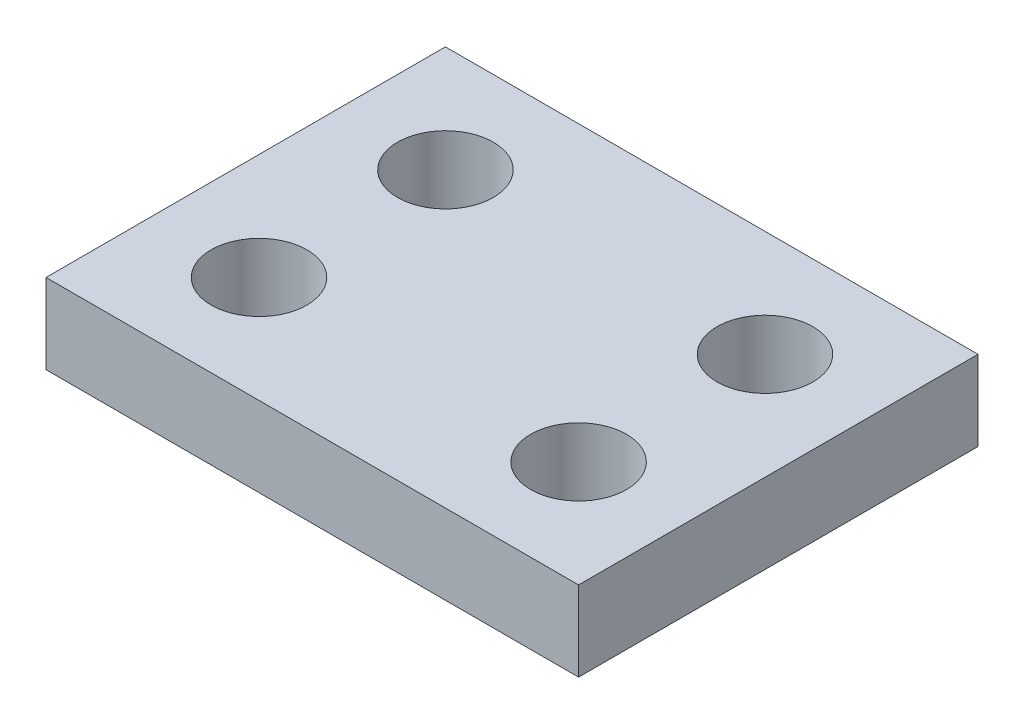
ISO-10303-21;
HEADER;
FILE_DESCRIPTION(('STEP AP214'),'2;1');
FILE_NAME('part.step','',(''),(''),'','','');
FILE_SCHEMA(('AUTOMOTIVE_DESIGN { 1 0 10303 214 1 1 1 1 }'));
ENDSEC;
DATA;
#1=APPLICATION_CONTEXT('core data for automotive mechanical design processes');
#2=APPLICATION_PROTOCOL_DEFINITION('international standard','automotive_design',2000,#1);
#3=PRODUCT_CONTEXT('',#1,'mechanical');
#4=PRODUCT('Part','Part','',(#3));
#5=PRODUCT_RELATED_PRODUCT_CATEGORY('part','',(#4));
#6=PRODUCT_DEFINITION_FORMATION('','',#4);
#7=PRODUCT_DEFINITION_CONTEXT('part definition',#1,'design');
#8=PRODUCT_DEFINITION('design','',#6,#7);
#9=PRODUCT_DEFINITION_SHAPE('','',#8);
#10=(LENGTH_UNIT() NAMED_UNIT(*) SI_UNIT(.MILLI.,.METRE.));
#11=(NAMED_UNIT(*) PLANE_ANGLE_UNIT() SI_UNIT($,.RADIAN.));
#12=(NAMED_UNIT(*) SI_UNIT($,.STERADIAN.) SOLID_ANGLE_UNIT());
#13=UNCERTAINTY_MEASURE_WITH_UNIT(LENGTH_MEASURE(1.E-05),#10,'distance_accuracy_value','');
#14=(GEOMETRIC_REPRESENTATION_CONTEXT(3) GLOBAL_UNCERTAINTY_ASSIGNED_CONTEXT((#13)) GLOBAL_UNIT_ASSIGNED_CONTEXT((#10,
#11,#12)) REPRESENTATION_CONTEXT('',''));
#15=CARTESIAN_POINT('',(0.,0.,0.));
#16=DIRECTION('',(0.,0.,1.));
#17=DIRECTION('',(1.,0.,0.));
#18=AXIS2_PLACEMENT_3D('',#15,#16,#17);
#19=CARTESIAN_POINT('',(50.,15.,37.5));
#20=DIRECTION('',(-1.,0.,0.));
#21=DIRECTION('',(0.,0.,1.));
#22=AXIS2_PLACEMENT_3D('',#19,#20,#21);
#23=PLANE('',#22);
#24=DIRECTION('',(0.,0.,-1.));
#25=VECTOR('',#24,1.);
#26=CARTESIAN_POINT('',(50.,0.,37.5));
#27=LINE('',#26,#25);
#28=CARTESIAN_POINT('',(50.,0.,37.5));
#29=VERTEX_POINT('',#28);
#30=CARTESIAN_POINT('',(50.,0.,-37.5));
#31=VERTEX_POINT('',#30);
#32=EDGE_CURVE('E97',#29,#31,#27,.T.);
#33=ORIENTED_EDGE('',*,*,#32,.T.);
#34=DIRECTION('',(0.,-1.,0.));
#35=VECTOR('',#34,1.);
#36=CARTESIAN_POINT('',(50.,15.,-37.5));
#37=LINE('',#36,#35);
#38=CARTESIAN_POINT('',(50.,15.,-37.5));
#39=VERTEX_POINT('',#38);
#40=EDGE_CURVE('E11',#39,#31,#37,.T.);
#41=ORIENTED_EDGE('',*,*,#40,.F.);
#42=DIRECTION('',(0.,0.,-1.));
#43=VECTOR('',#42,1.);
#44=CARTESIAN_POINT('',(50.,15.,37.5));
#45=LINE('',#44,#43);
#46=CARTESIAN_POINT('',(50.,15.,37.5));
#47=VERTEX_POINT('',#46);
#48=EDGE_CURVE('E85',#47,#39,#45,.T.);
#49=ORIENTED_EDGE('',*,*,#48,.F.);
#50=DIRECTION('',(0.,-1.,0.));
#51=VECTOR('',#50,1.);
#52=CARTESIAN_POINT('',(50.,15.,37.5));
#53=LINE('',#52,#51);
#54=EDGE_CURVE('E93',#47,#29,#53,.T.);
#55=ORIENTED_EDGE('',*,*,#54,.T.);
#56=EDGE_LOOP('',(#33,#41,#49,#55));
#57=FACE_BOUND('',#56,.T.);
#58=ADVANCED_FACE('F34',(#57),#23,.F.);
#59=CARTESIAN_POINT('',(-50.,15.,-37.5));
#60=DIRECTION('',(0.,0.,1.));
#61=DIRECTION('',(1.,0.,0.));
#62=AXIS2_PLACEMENT_3D('',#59,#60,#61);
#63=PLANE('',#62);
#64=DIRECTION('',(-1.,0.,0.));
#65=VECTOR('',#64,1.);
#66=CARTESIAN_POINT('',(-50.,0.,-37.5));
#67=LINE('',#66,#65);
#68=CARTESIAN_POINT('',(-50.,0.,-37.5));
#69=VERTEX_POINT('',#68);
#70=EDGE_CURVE('E89',#31,#69,#67,.T.);
#71=ORIENTED_EDGE('',*,*,#70,.T.);
#72=DIRECTION('',(0.,-1.,0.));
#73=VECTOR('',#72,1.);
#74=CARTESIAN_POINT('',(-50.,15.,-37.5));
#75=LINE('',#74,#73);
#76=CARTESIAN_POINT('',(-50.,15.,-37.5));
#77=VERTEX_POINT('',#76);
#78=EDGE_CURVE('E42',#77,#69,#75,.T.);
#79=ORIENTED_EDGE('',*,*,#78,.F.);
#80=DIRECTION('',(-1.,0.,0.));
#81=VECTOR('',#80,1.);
#82=CARTESIAN_POINT('',(-50.,15.,-37.5));
#83=LINE('',#82,#81);
#84=EDGE_CURVE('E80',#39,#77,#83,.T.);
#85=ORIENTED_EDGE('',*,*,#84,.F.);
#86=ORIENTED_EDGE('',*,*,#40,.T.);
#87=EDGE_LOOP('',(#71,#79,#85,#86));
#88=FACE_BOUND('',#87,.T.);
#89=ADVANCED_FACE('F88',(#88),#63,.F.);
#90=CARTESIAN_POINT('',(-50.,15.,37.5));
#91=DIRECTION('',(1.,0.,0.));
#92=DIRECTION('',(0.,0.,-1.));
#93=AXIS2_PLACEMENT_3D('',#90,#91,#92);
#94=PLANE('',#93);
#95=DIRECTION('',(0.,0.,1.));
#96=VECTOR('',#95,1.);
#97=CARTESIAN_POINT('',(-50.,0.,37.5));
#98=LINE('',#97,#96);
#99=CARTESIAN_POINT('',(-50.,0.,37.5));
#100=VERTEX_POINT('',#99);
#101=EDGE_CURVE('E67',#69,#100,#98,.T.);
#102=ORIENTED_EDGE('',*,*,#101,.T.);
#103=DIRECTION('',(0.,-1.,0.));
#104=VECTOR('',#103,1.);
#105=CARTESIAN_POINT('',(-50.,15.,37.5));
#106=LINE('',#105,#104);
#107=CARTESIAN_POINT('',(-50.,15.,37.5));
#108=VERTEX_POINT('',#107);
#109=EDGE_CURVE('E90',#108,#100,#106,.T.);
#110=ORIENTED_EDGE('',*,*,#109,.F.);
#111=DIRECTION('',(0.,0.,1.));
#112=VECTOR('',#111,1.);
#113=CARTESIAN_POINT('',(-50.,15.,37.5));
#114=LINE('',#113,#112);
#115=EDGE_CURVE('E83',#77,#108,#114,.T.);
#116=ORIENTED_EDGE('',*,*,#115,.F.);
#117=ORIENTED_EDGE('',*,*,#78,.T.);
#118=EDGE_LOOP('',(#102,#110,#116,#117));
#119=FACE_BOUND('',#118,.T.);
#120=ADVANCED_FACE('F91',(#119),#94,.F.);
#121=CARTESIAN_POINT('',(-50.,15.,37.5));
#122=DIRECTION('',(0.,0.,-1.));
#123=DIRECTION('',(-1.,0.,0.));
#124=AXIS2_PLACEMENT_3D('',#121,#122,#123);
#125=PLANE('',#124);
#126=DIRECTION('',(1.,0.,0.));
#127=VECTOR('',#126,1.);
#128=CARTESIAN_POINT('',(-50.,0.,37.5));
#129=LINE('',#128,#127);
#130=EDGE_CURVE('E73',#100,#29,#129,.T.);
#131=ORIENTED_EDGE('',*,*,#130,.T.);
#132=ORIENTED_EDGE('',*,*,#54,.F.);
#133=DIRECTION('',(1.,0.,0.));
#134=VECTOR('',#133,1.);
#135=CARTESIAN_POINT('',(-50.,15.,37.5));
#136=LINE('',#135,#134);
#137=EDGE_CURVE('E50',#108,#47,#136,.T.);
#138=ORIENTED_EDGE('',*,*,#137,.F.);
#139=ORIENTED_EDGE('',*,*,#109,.T.);
#140=EDGE_LOOP('',(#131,#132,#138,#139));
#141=FACE_BOUND('',#140,.T.);
#142=ADVANCED_FACE('F105',(#141),#125,.F.);
#143=CARTESIAN_POINT('',(0.,15.,0.));
#144=DIRECTION('',(0.,-1.,0.));
#145=DIRECTION('',(0.,0.,-1.));
#146=AXIS2_PLACEMENT_3D('',#143,#144,#145);
#147=PLANE('',#146);
#148=CARTESIAN_POINT('',(-30.,15.,17.5));
#149=DIRECTION('',(0.,1.,0.));
#150=DIRECTION('',(0.,0.,1.));
#151=AXIS2_PLACEMENT_3D('',#148,#149,#150);
#152=CIRCLE('',#151,8.99999999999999);
#153=CARTESIAN_POINT('',(-30.,15.,26.5));
#154=VERTEX_POINT('',#153);
#155=EDGE_CURVE('E131',#154,#154,#152,.T.);
#156=ORIENTED_EDGE('',*,*,#155,.F.);
#157=EDGE_LOOP('',(#156));
#158=FACE_BOUND('',#157,.T.);
#159=CARTESIAN_POINT('',(-30.,15.,-17.5));
#160=DIRECTION('',(0.,1.,0.));
#161=DIRECTION('',(0.,0.,1.));
#162=AXIS2_PLACEMENT_3D('',#159,#160,#161);
#163=CIRCLE('',#162,8.99999999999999);
#164=CARTESIAN_POINT('',(-30.,15.,-8.50000000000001));
#165=VERTEX_POINT('',#164);
#166=EDGE_CURVE('E125',#165,#165,#163,.T.);
#167=ORIENTED_EDGE('',*,*,#166,.F.);
#168=EDGE_LOOP('',(#167));
#169=FACE_BOUND('',#168,.T.);
#170=CARTESIAN_POINT('',(30.,15.,-17.5));
#171=DIRECTION('',(0.,1.,0.));
#172=DIRECTION('',(0.,0.,1.));
#173=AXIS2_PLACEMENT_3D('',#170,#171,#172);
#174=CIRCLE('',#173,8.99999999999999);
#175=CARTESIAN_POINT('',(30.,15.,-8.5));
#176=VERTEX_POINT('',#175);
#177=EDGE_CURVE('E119',#176,#176,#174,.T.);
#178=ORIENTED_EDGE('',*,*,#177,.F.);
#179=EDGE_LOOP('',(#178));
#180=FACE_BOUND('',#179,.T.);
#181=CARTESIAN_POINT('',(30.,15.,17.5));
#182=DIRECTION('',(0.,1.,0.));
#183=DIRECTION('',(0.,0.,1.));
#184=AXIS2_PLACEMENT_3D('',#181,#182,#183);
#185=CIRCLE('',#184,8.99999999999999);
#186=CARTESIAN_POINT('',(30.,15.,26.5));
#187=VERTEX_POINT('',#186);
#188=EDGE_CURVE('E113',#187,#187,#185,.T.);
#189=ORIENTED_EDGE('',*,*,#188,.F.);
#190=EDGE_LOOP('',(#189));
#191=FACE_BOUND('',#190,.T.);
#192=ORIENTED_EDGE('',*,*,#48,.T.);
#193=ORIENTED_EDGE('',*,*,#84,.T.);
#194=ORIENTED_EDGE('',*,*,#115,.T.);
#195=ORIENTED_EDGE('',*,*,#137,.T.);
#196=EDGE_LOOP('',(#192,#193,#194,#195));
#197=FACE_BOUND('',#196,.T.);
#198=ADVANCED_FACE('F81',(#158,#169,#180,#191,#197),#147,.F.);
#199=CARTESIAN_POINT('',(0.,0.,0.));
#200=DIRECTION('',(0.,-1.,0.));
#201=DIRECTION('',(0.,0.,-1.));
#202=AXIS2_PLACEMENT_3D('',#199,#200,#201);
#203=PLANE('',#202);
#204=CARTESIAN_POINT('',(-30.,0.,17.5));
#205=DIRECTION('',(0.,1.,0.));
#206=DIRECTION('',(0.,0.,1.));
#207=AXIS2_PLACEMENT_3D('',#204,#205,#206);
#208=CIRCLE('',#207,9.);
#209=CARTESIAN_POINT('',(-30.,0.,26.5));
#210=VERTEX_POINT('',#209);
#211=EDGE_CURVE('E128',#210,#210,#208,.T.);
#212=ORIENTED_EDGE('',*,*,#211,.T.);
#213=EDGE_LOOP('',(#212));
#214=FACE_BOUND('',#213,.T.);
#215=CARTESIAN_POINT('',(-30.,0.,-17.5));
#216=DIRECTION('',(0.,1.,0.));
#217=DIRECTION('',(0.,0.,1.));
#218=AXIS2_PLACEMENT_3D('',#215,#216,#217);
#219=CIRCLE('',#218,9.);
#220=CARTESIAN_POINT('',(-30.,0.,-8.5));
#221=VERTEX_POINT('',#220);
#222=EDGE_CURVE('E122',#221,#221,#219,.T.);
#223=ORIENTED_EDGE('',*,*,#222,.T.);
#224=EDGE_LOOP('',(#223));
#225=FACE_BOUND('',#224,.T.);
#226=CARTESIAN_POINT('',(30.,0.,-17.5));
#227=DIRECTION('',(0.,1.,0.));
#228=DIRECTION('',(0.,0.,1.));
#229=AXIS2_PLACEMENT_3D('',#226,#227,#228);
#230=CIRCLE('',#229,9.);
#231=CARTESIAN_POINT('',(30.,0.,-8.5));
#232=VERTEX_POINT('',#231);
#233=EDGE_CURVE('E116',#232,#232,#230,.T.);
#234=ORIENTED_EDGE('',*,*,#233,.T.);
#235=EDGE_LOOP('',(#234));
#236=FACE_BOUND('',#235,.T.);
#237=CARTESIAN_POINT('',(30.,0.,17.5));
#238=DIRECTION('',(0.,1.,0.));
#239=DIRECTION('',(0.,0.,1.));
#240=AXIS2_PLACEMENT_3D('',#237,#238,#239);
#241=CIRCLE('',#240,9.);
#242=CARTESIAN_POINT('',(30.,0.,26.5));
#243=VERTEX_POINT('',#242);
#244=EDGE_CURVE('E100',#243,#243,#241,.T.);
#245=ORIENTED_EDGE('',*,*,#244,.T.);
#246=EDGE_LOOP('',(#245));
#247=FACE_BOUND('',#246,.T.);
#248=ORIENTED_EDGE('',*,*,#32,.F.);
#249=ORIENTED_EDGE('',*,*,#130,.F.);
#250=ORIENTED_EDGE('',*,*,#101,.F.);
#251=ORIENTED_EDGE('',*,*,#70,.F.);
#252=EDGE_LOOP('',(#248,#249,#250,#251));
#253=FACE_BOUND('',#252,.T.);
#254=ADVANCED_FACE('F108',(#214,#225,#236,#247,#253),#203,.T.);
#255=CARTESIAN_POINT('',(30.,15.,17.5));
#256=DIRECTION('',(0.,1.,0.));
#257=DIRECTION('',(0.,0.,1.));
#258=AXIS2_PLACEMENT_3D('',#255,#256,#257);
#259=CYLINDRICAL_SURFACE('',#258,8.99999999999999);
#260=ORIENTED_EDGE('',*,*,#244,.F.);
#261=EDGE_LOOP('',(#260));
#262=FACE_BOUND('',#261,.T.);
#263=ORIENTED_EDGE('',*,*,#188,.T.);
#264=EDGE_LOOP('',(#263));
#265=FACE_BOUND('',#264,.T.);
#266=ADVANCED_FACE('F146',(#262,#265),#259,.F.);
#267=CARTESIAN_POINT('',(30.,15.,-17.5));
#268=DIRECTION('',(0.,1.,0.));
#269=DIRECTION('',(0.,0.,1.));
#270=AXIS2_PLACEMENT_3D('',#267,#268,#269);
#271=CYLINDRICAL_SURFACE('',#270,8.99999999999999);
#272=ORIENTED_EDGE('',*,*,#233,.F.);
#273=EDGE_LOOP('',(#272));
#274=FACE_BOUND('',#273,.T.);
#275=ORIENTED_EDGE('',*,*,#177,.T.);
#276=EDGE_LOOP('',(#275));
#277=FACE_BOUND('',#276,.T.);
#278=ADVANCED_FACE('F148',(#274,#277),#271,.F.);
#279=CARTESIAN_POINT('',(-30.,15.,-17.5));
#280=DIRECTION('',(0.,1.,0.));
#281=DIRECTION('',(0.,0.,1.));
#282=AXIS2_PLACEMENT_3D('',#279,#280,#281);
#283=CYLINDRICAL_SURFACE('',#282,8.99999999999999);
#284=ORIENTED_EDGE('',*,*,#222,.F.);
#285=EDGE_LOOP('',(#284));
#286=FACE_BOUND('',#285,.T.);
#287=ORIENTED_EDGE('',*,*,#166,.T.);
#288=EDGE_LOOP('',(#287));
#289=FACE_BOUND('',#288,.T.);
#290=ADVANCED_FACE('F155',(#286,#289),#283,.F.);
#291=CARTESIAN_POINT('',(-30.,15.,17.5));
#292=DIRECTION('',(0.,1.,0.));
#293=DIRECTION('',(0.,0.,1.));
#294=AXIS2_PLACEMENT_3D('',#291,#292,#293);
#295=CYLINDRICAL_SURFACE('',#294,8.99999999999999);
#296=ORIENTED_EDGE('',*,*,#211,.F.);
#297=EDGE_LOOP('',(#296));
#298=FACE_BOUND('',#297,.T.);
#299=ORIENTED_EDGE('',*,*,#155,.T.);
#300=EDGE_LOOP('',(#299));
#301=FACE_BOUND('',#300,.T.);
#302=ADVANCED_FACE('F135',(#298,#301),#295,.F.);
#303=CLOSED_SHELL('',(#58,#89,#120,#142,#198,#254,#266,#278,#290,#302));
#304=MANIFOLD_SOLID_BREP('B2',#303);
#305=ADVANCED_BREP_SHAPE_REPRESENTATION('',(#18,#304),#14);
#306=SHAPE_DEFINITION_REPRESENTATION(#9,#305);
ENDSEC;
END-ISO-10303-21;
